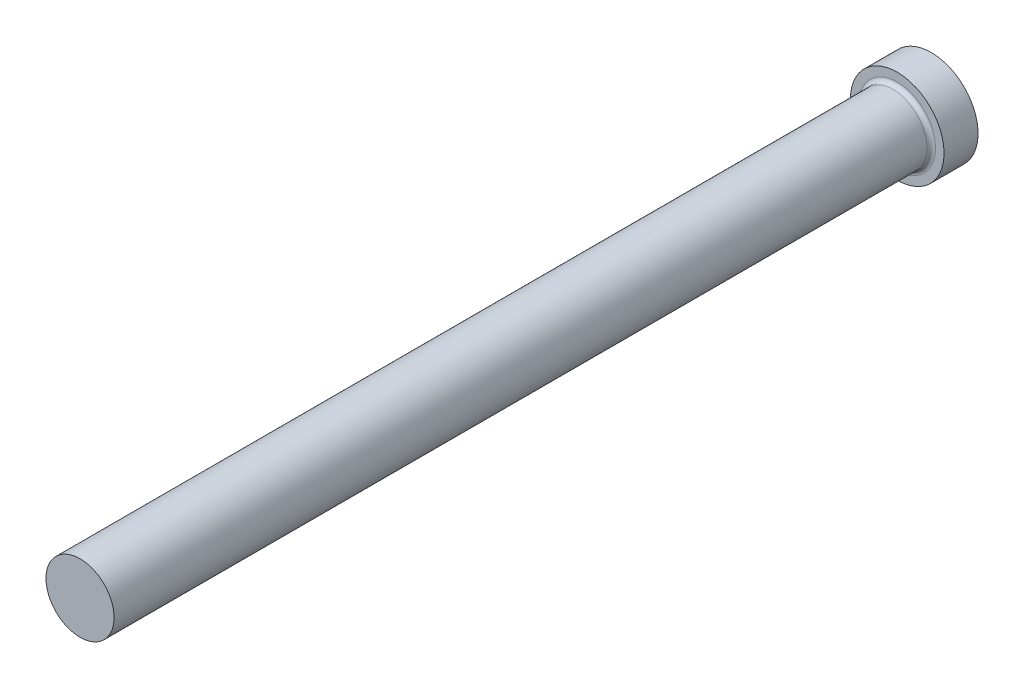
from build123d import *

# Parameters (mm, degrees)
FILLET1_R = 0.5


with BuildPart() as part:
    # FV → Revolve1 (revolve)
    with BuildSketch(Plane(origin=(0, 0, 0), x_dir=(1, 0, 0), z_dir=(0, 1, 0)), mode=Mode.PRIVATE) as revolve1_sk:
        Polygon((0, 0), (5.5, 0), (5.5, -4), (4, -4), (4, -100), (0, -100), align=None)
    revolve(revolve1_sk.sketch.rotate(Axis((0, 0, -9.033228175), (0, 0, 1)), 180), axis=Axis((0, 0, -9.033228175), (0, 0, 1)))

    # Fillet1
    fillet1_edges = [part.edges().sort_by_distance(p)[0] for p in [
        (4, 0, 4),
    ]]
    fillet(fillet1_edges, radius=FILLET1_R)


solid = part.part
